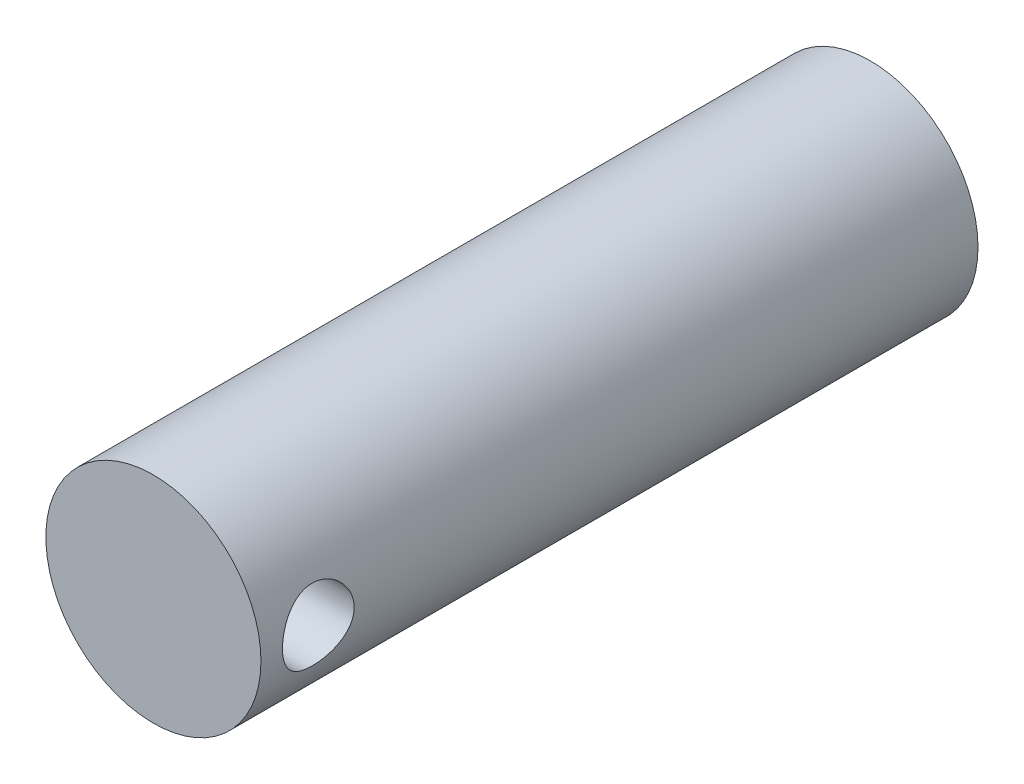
ISO-10303-21;
HEADER;
FILE_DESCRIPTION(('STEP AP214'),'2;1');
FILE_NAME('part.step','',(''),(''),'','','');
FILE_SCHEMA(('AUTOMOTIVE_DESIGN { 1 0 10303 214 1 1 1 1 }'));
ENDSEC;
DATA;
#1=APPLICATION_CONTEXT('core data for automotive mechanical design processes');
#2=APPLICATION_PROTOCOL_DEFINITION('international standard','automotive_design',2000,#1);
#3=PRODUCT_CONTEXT('',#1,'mechanical');
#4=PRODUCT('Part','Part','',(#3));
#5=PRODUCT_RELATED_PRODUCT_CATEGORY('part','',(#4));
#6=PRODUCT_DEFINITION_FORMATION('','',#4);
#7=PRODUCT_DEFINITION_CONTEXT('part definition',#1,'design');
#8=PRODUCT_DEFINITION('design','',#6,#7);
#9=PRODUCT_DEFINITION_SHAPE('','',#8);
#10=(LENGTH_UNIT() NAMED_UNIT(*) SI_UNIT(.MILLI.,.METRE.));
#11=(NAMED_UNIT(*) PLANE_ANGLE_UNIT() SI_UNIT($,.RADIAN.));
#12=(NAMED_UNIT(*) SI_UNIT($,.STERADIAN.) SOLID_ANGLE_UNIT());
#13=UNCERTAINTY_MEASURE_WITH_UNIT(LENGTH_MEASURE(1.E-05),#10,'distance_accuracy_value','');
#14=(GEOMETRIC_REPRESENTATION_CONTEXT(3) GLOBAL_UNCERTAINTY_ASSIGNED_CONTEXT((#13)) GLOBAL_UNIT_ASSIGNED_CONTEXT((#10,
#11,#12)) REPRESENTATION_CONTEXT('',''));
#15=CARTESIAN_POINT('',(0.,0.,0.));
#16=DIRECTION('',(0.,0.,1.));
#17=DIRECTION('',(1.,0.,0.));
#18=AXIS2_PLACEMENT_3D('',#15,#16,#17);
#19=CARTESIAN_POINT('',(0.,0.,50.));
#20=DIRECTION('',(0.,0.,-1.));
#21=DIRECTION('',(-1.,0.,0.));
#22=AXIS2_PLACEMENT_3D('',#19,#20,#21);
#23=CYLINDRICAL_SURFACE('',#22,7.5);
#24=CARTESIAN_POINT('',(-7.5,0.,48.5));
#25=CARTESIAN_POINT('',(-7.5000003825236,-0.136408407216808,48.5000006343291));
#26=CARTESIAN_POINT('',(-7.49624423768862,-0.272812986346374,48.488799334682));
#27=CARTESIAN_POINT('',(-7.48163025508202,-0.54160440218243,48.444427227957));
#28=CARTESIAN_POINT('',(-7.47077168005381,-0.673990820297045,48.4112541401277));
#29=CARTESIAN_POINT('',(-7.44313269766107,-0.93083197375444,48.3242018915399));
#30=CARTESIAN_POINT('',(-7.42636219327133,-1.05529956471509,48.2703573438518));
#31=CARTESIAN_POINT('',(-7.38861114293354,-1.29343734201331,48.1436470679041));
#32=CARTESIAN_POINT('',(-7.36762976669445,-1.40710539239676,48.0707775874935));
#33=CARTESIAN_POINT('',(-7.32285236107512,-1.62435418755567,47.9054354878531));
#34=CARTESIAN_POINT('',(-7.29898891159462,-1.72750925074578,47.8124219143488));
#35=CARTESIAN_POINT('',(-7.25150786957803,-1.91708173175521,47.6105821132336));
#36=CARTESIAN_POINT('',(-7.22789033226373,-2.00349546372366,47.5017524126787));
#37=CARTESIAN_POINT('',(-7.18283331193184,-2.15956235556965,47.2675372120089));
#38=CARTESIAN_POINT('',(-7.1614759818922,-2.22866214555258,47.1417656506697));
#39=CARTESIAN_POINT('',(-7.12438263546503,-2.3445471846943,46.8795597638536));
#40=CARTESIAN_POINT('',(-7.10864490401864,-2.39133924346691,46.7431287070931));
#41=CARTESIAN_POINT('',(-7.08528258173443,-2.45968365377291,46.4683169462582));
#42=CARTESIAN_POINT('',(-7.07740239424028,-2.48203362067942,46.3301569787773));
#43=CARTESIAN_POINT('',(-7.06989141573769,-2.5033528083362,46.0518406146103));
#44=CARTESIAN_POINT('',(-7.07025807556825,-2.5023292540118,45.911684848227));
#45=CARTESIAN_POINT('',(-7.0789753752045,-2.47754975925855,45.6401584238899));
#46=CARTESIAN_POINT('',(-7.08696039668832,-2.45483478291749,45.5086789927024));
#47=CARTESIAN_POINT('',(-7.10941644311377,-2.38901540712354,45.2515164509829));
#48=CARTESIAN_POINT('',(-7.12388824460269,-2.34590856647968,45.1258340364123));
#49=CARTESIAN_POINT('',(-7.15794777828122,-2.23984764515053,44.8814681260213));
#50=CARTESIAN_POINT('',(-7.17761414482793,-2.17658512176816,44.7629299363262));
#51=CARTESIAN_POINT('',(-7.21981396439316,-2.03222276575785,44.5378227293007));
#52=CARTESIAN_POINT('',(-7.24234824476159,-1.95111778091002,44.4312571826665));
#53=CARTESIAN_POINT('',(-7.28918322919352,-1.7683733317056,44.2272710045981));
#54=CARTESIAN_POINT('',(-7.31351473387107,-1.66588287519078,44.1306182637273));
#55=CARTESIAN_POINT('',(-7.36017345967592,-1.44584892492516,43.9556718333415));
#56=CARTESIAN_POINT('',(-7.38250048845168,-1.32830398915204,43.8773799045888));
#57=CARTESIAN_POINT('',(-7.42292769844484,-1.07986903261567,43.7407592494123));
#58=CARTESIAN_POINT('',(-7.44098375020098,-0.948858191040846,43.6826362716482));
#59=CARTESIAN_POINT('',(-7.47051417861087,-0.678172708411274,43.5894920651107));
#60=CARTESIAN_POINT('',(-7.48199084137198,-0.538501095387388,43.5544628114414));
#61=CARTESIAN_POINT('',(-7.49669067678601,-0.260959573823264,43.5098608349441));
#62=CARTESIAN_POINT('',(-7.5002500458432,-0.123273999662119,43.4992504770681));
#63=CARTESIAN_POINT('',(-7.49972256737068,0.15193767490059,43.5008316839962));
#64=CARTESIAN_POINT('',(-7.49563701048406,0.289463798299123,43.5130193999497));
#65=CARTESIAN_POINT('',(-7.48050061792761,0.556299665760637,43.5590297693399));
#66=CARTESIAN_POINT('',(-7.46965496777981,0.685732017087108,43.5922155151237));
#67=CARTESIAN_POINT('',(-7.44229617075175,0.937139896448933,43.6784836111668));
#68=CARTESIAN_POINT('',(-7.42578230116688,1.05911447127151,43.7315684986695));
#69=CARTESIAN_POINT('',(-7.38822328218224,1.29572074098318,43.857676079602));
#70=CARTESIAN_POINT('',(-7.36707036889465,1.41007489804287,43.9311864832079));
#71=CARTESIAN_POINT('',(-7.32263134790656,1.62516207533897,44.0954853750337));
#72=CARTESIAN_POINT('',(-7.29934458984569,1.72589091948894,44.1862791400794));
#73=CARTESIAN_POINT('',(-7.25192119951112,1.91563126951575,44.3874468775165));
#74=CARTESIAN_POINT('',(-7.2277940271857,2.00390242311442,44.4985230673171));
#75=CARTESIAN_POINT('',(-7.18249933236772,2.16064380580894,44.7344289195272));
#76=CARTESIAN_POINT('',(-7.16133183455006,2.22911386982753,44.8592586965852));
#77=CARTESIAN_POINT('',(-7.12455979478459,2.34399232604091,45.1191825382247));
#78=CARTESIAN_POINT('',(-7.10894401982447,2.39044533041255,45.2542551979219));
#79=CARTESIAN_POINT('',(-7.08527080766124,2.45973666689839,45.5309466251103));
#80=CARTESIAN_POINT('',(-7.07720996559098,2.48258563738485,45.6725624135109));
#81=CARTESIAN_POINT('',(-7.06994647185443,2.50319070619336,45.9504927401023));
#82=CARTESIAN_POINT('',(-7.07031000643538,2.502175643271,46.0867058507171));
#83=CARTESIAN_POINT('',(-7.07878174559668,2.47810573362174,46.3569126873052));
#84=CARTESIAN_POINT('',(-7.08688948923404,2.45505219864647,46.4909065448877));
#85=CARTESIAN_POINT('',(-7.10961310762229,2.38842953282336,46.7503391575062));
#86=CARTESIAN_POINT('',(-7.12410245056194,2.34525836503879,46.8758920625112));
#87=CARTESIAN_POINT('',(-7.15790997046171,2.23994841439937,47.1180685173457));
#88=CARTESIAN_POINT('',(-7.17722921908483,2.17780542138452,47.23469007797));
#89=CARTESIAN_POINT('',(-7.21957073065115,2.03315173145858,47.4612091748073));
#90=CARTESIAN_POINT('',(-7.24271779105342,1.94987060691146,47.570591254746));
#91=CARTESIAN_POINT('',(-7.28958390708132,1.76660720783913,47.7742245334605));
#92=CARTESIAN_POINT('',(-7.3133031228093,1.66662021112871,47.8684714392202));
#93=CARTESIAN_POINT('',(-7.3597507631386,1.44810389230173,48.0428610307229));
#94=CARTESIAN_POINT('',(-7.38240454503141,1.32900378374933,48.1223108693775));
#95=CARTESIAN_POINT('',(-7.4231497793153,1.07839339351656,48.2599760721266));
#96=CARTESIAN_POINT('',(-7.44124239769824,0.946886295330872,48.3181968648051));
#97=CARTESIAN_POINT('',(-7.47013787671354,0.681234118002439,48.4093040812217));
#98=CARTESIAN_POINT('',(-7.48123031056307,0.547469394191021,48.4432061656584));
#99=CARTESIAN_POINT('',(-7.49616017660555,0.275801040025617,48.4885507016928));
#100=CARTESIAN_POINT('',(-7.49999961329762,0.137898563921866,48.4999993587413));
#101=CARTESIAN_POINT('',(-7.5,0.,48.5));
#102=B_SPLINE_CURVE_WITH_KNOTS('',3,(#24,#25,#26,#27,#28,#29,#30,#31,#32,#33,#34,#35,#36,#37,
#38,#39,#40,#41,#42,#43,#44,#45,#46,#47,#48,#49,#50,#51,#52,#53,#54,#55,#56,#57,#58,#59,#60,#61,
#62,#63,#64,#65,#66,#67,#68,#69,#70,#71,#72,#73,#74,#75,#76,#77,#78,#79,#80,#81,#82,#83,#84,#85,
#86,#87,#88,#89,#90,#91,#92,#93,#94,#95,#96,#97,#98,#99,#100,#101),.UNSPECIFIED.,.T.,.F.,(4,2,2,
2,2,2,2,2,2,2,2,2,2,2,2,2,2,2,2,2,2,2,2,2,2,2,2,2,2,2,2,2,2,2,2,2,2,2,4),(0.,0.408717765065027,
0.817477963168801,1.22555668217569,1.63371594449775,2.0546171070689,2.47561083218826,
2.90870962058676,3.34167611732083,3.760048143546,4.17829084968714,4.57742066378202,
4.97659827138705,5.38220427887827,5.78792756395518,6.21483264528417,6.64177864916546,
7.07296014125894,7.50399172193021,7.91633957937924,8.32861782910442,8.72895394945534,
9.1293411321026,9.54025999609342,9.95130452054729,10.3810255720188,10.8107502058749,
11.2396003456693,11.668257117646,12.0748916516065,12.4815019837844,12.8803896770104,
13.2793659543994,13.6957516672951,14.1122552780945,14.5449915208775,14.9776170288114,
15.3909139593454,15.8040966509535),.UNSPECIFIED.);
#103=CARTESIAN_POINT('',(-7.5,0.,48.5));
#104=VERTEX_POINT('',#103);
#105=EDGE_CURVE('E36',#104,#104,#102,.T.);
#106=ORIENTED_EDGE('',*,*,#105,.T.);
#107=EDGE_LOOP('',(#106));
#108=FACE_BOUND('',#107,.T.);
#109=CARTESIAN_POINT('',(7.5,0.,43.5));
#110=CARTESIAN_POINT('',(7.5000003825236,-0.136408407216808,43.4999993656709));
#111=CARTESIAN_POINT('',(7.49624423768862,-0.272812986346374,43.511200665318));
#112=CARTESIAN_POINT('',(7.48163025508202,-0.54160440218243,43.555572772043));
#113=CARTESIAN_POINT('',(7.47077168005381,-0.673990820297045,43.5887458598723));
#114=CARTESIAN_POINT('',(7.44313269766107,-0.93083197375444,43.6757981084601));
#115=CARTESIAN_POINT('',(7.42636219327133,-1.05529956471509,43.7296426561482));
#116=CARTESIAN_POINT('',(7.38861114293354,-1.29343734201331,43.8563529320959));
#117=CARTESIAN_POINT('',(7.36762976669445,-1.40710539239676,43.9292224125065));
#118=CARTESIAN_POINT('',(7.32285236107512,-1.62435418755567,44.0945645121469));
#119=CARTESIAN_POINT('',(7.29898891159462,-1.72750925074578,44.1875780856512));
#120=CARTESIAN_POINT('',(7.25150786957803,-1.91708173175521,44.3894178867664));
#121=CARTESIAN_POINT('',(7.22789033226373,-2.00349546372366,44.4982475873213));
#122=CARTESIAN_POINT('',(7.18283331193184,-2.15956235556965,44.7324627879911));
#123=CARTESIAN_POINT('',(7.1614759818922,-2.22866214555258,44.8582343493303));
#124=CARTESIAN_POINT('',(7.12438263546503,-2.3445471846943,45.1204402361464));
#125=CARTESIAN_POINT('',(7.10864490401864,-2.39133924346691,45.2568712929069));
#126=CARTESIAN_POINT('',(7.08528258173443,-2.45968365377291,45.5316830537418));
#127=CARTESIAN_POINT('',(7.07740239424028,-2.48203362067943,45.6698430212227));
#128=CARTESIAN_POINT('',(7.06989141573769,-2.5033528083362,45.9481593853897));
#129=CARTESIAN_POINT('',(7.07025807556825,-2.5023292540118,46.088315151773));
#130=CARTESIAN_POINT('',(7.0789753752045,-2.47754975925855,46.3598415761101));
#131=CARTESIAN_POINT('',(7.08696039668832,-2.45483478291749,46.4913210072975));
#132=CARTESIAN_POINT('',(7.10941644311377,-2.38901540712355,46.7484835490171));
#133=CARTESIAN_POINT('',(7.12388824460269,-2.34590856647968,46.8741659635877));
#134=CARTESIAN_POINT('',(7.15794777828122,-2.23984764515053,47.1185318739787));
#135=CARTESIAN_POINT('',(7.17761414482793,-2.17658512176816,47.2370700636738));
#136=CARTESIAN_POINT('',(7.21981396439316,-2.03222276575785,47.4621772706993));
#137=CARTESIAN_POINT('',(7.24234824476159,-1.95111778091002,47.5687428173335));
#138=CARTESIAN_POINT('',(7.28918322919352,-1.7683733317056,47.7727289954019));
#139=CARTESIAN_POINT('',(7.31351473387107,-1.66588287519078,47.8693817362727));
#140=CARTESIAN_POINT('',(7.36017345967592,-1.44584892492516,48.0443281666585));
#141=CARTESIAN_POINT('',(7.38250048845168,-1.32830398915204,48.1226200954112));
#142=CARTESIAN_POINT('',(7.42292769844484,-1.07986903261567,48.2592407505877));
#143=CARTESIAN_POINT('',(7.44098375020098,-0.948858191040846,48.3173637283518));
#144=CARTESIAN_POINT('',(7.47051417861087,-0.678172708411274,48.4105079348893));
#145=CARTESIAN_POINT('',(7.48199084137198,-0.538501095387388,48.4455371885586));
#146=CARTESIAN_POINT('',(7.49669067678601,-0.260959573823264,48.4901391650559));
#147=CARTESIAN_POINT('',(7.5002500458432,-0.123273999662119,48.5007495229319));
#148=CARTESIAN_POINT('',(7.49972256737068,0.15193767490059,48.4991683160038));
#149=CARTESIAN_POINT('',(7.49563701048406,0.289463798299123,48.4869806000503));
#150=CARTESIAN_POINT('',(7.48050061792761,0.556299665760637,48.4409702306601));
#151=CARTESIAN_POINT('',(7.46965496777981,0.685732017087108,48.4077844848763));
#152=CARTESIAN_POINT('',(7.44229617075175,0.937139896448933,48.3215163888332));
#153=CARTESIAN_POINT('',(7.42578230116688,1.05911447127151,48.2684315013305));
#154=CARTESIAN_POINT('',(7.38822328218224,1.29572074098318,48.142323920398));
#155=CARTESIAN_POINT('',(7.36707036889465,1.41007489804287,48.0688135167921));
#156=CARTESIAN_POINT('',(7.32263134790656,1.62516207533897,47.9045146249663));
#157=CARTESIAN_POINT('',(7.29934458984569,1.72589091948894,47.8137208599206));
#158=CARTESIAN_POINT('',(7.25192119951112,1.91563126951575,47.6125531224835));
#159=CARTESIAN_POINT('',(7.2277940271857,2.00390242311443,47.5014769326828));
#160=CARTESIAN_POINT('',(7.18249933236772,2.16064380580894,47.2655710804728));
#161=CARTESIAN_POINT('',(7.16133183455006,2.22911386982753,47.1407413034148));
#162=CARTESIAN_POINT('',(7.12455979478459,2.34399232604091,46.8808174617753));
#163=CARTESIAN_POINT('',(7.10894401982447,2.39044533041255,46.7457448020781));
#164=CARTESIAN_POINT('',(7.08527080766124,2.45973666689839,46.4690533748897));
#165=CARTESIAN_POINT('',(7.07720996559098,2.48258563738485,46.3274375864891));
#166=CARTESIAN_POINT('',(7.06994647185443,2.50319070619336,46.0495072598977));
#167=CARTESIAN_POINT('',(7.07031000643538,2.502175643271,45.9132941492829));
#168=CARTESIAN_POINT('',(7.07878174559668,2.47810573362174,45.6430873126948));
#169=CARTESIAN_POINT('',(7.08688948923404,2.45505219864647,45.5090934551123));
#170=CARTESIAN_POINT('',(7.10961310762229,2.38842953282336,45.2496608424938));
#171=CARTESIAN_POINT('',(7.12410245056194,2.34525836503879,45.1241079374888));
#172=CARTESIAN_POINT('',(7.15790997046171,2.23994841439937,44.8819314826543));
#173=CARTESIAN_POINT('',(7.17722921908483,2.17780542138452,44.76530992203));
#174=CARTESIAN_POINT('',(7.21957073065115,2.03315173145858,44.5387908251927));
#175=CARTESIAN_POINT('',(7.24271779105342,1.94987060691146,44.429408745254));
#176=CARTESIAN_POINT('',(7.28958390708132,1.76660720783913,44.2257754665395));
#177=CARTESIAN_POINT('',(7.3133031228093,1.66662021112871,44.1315285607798));
#178=CARTESIAN_POINT('',(7.3597507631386,1.44810389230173,43.9571389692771));
#179=CARTESIAN_POINT('',(7.38240454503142,1.32900378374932,43.8776891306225));
#180=CARTESIAN_POINT('',(7.4231497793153,1.07839339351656,43.7400239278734));
#181=CARTESIAN_POINT('',(7.44124239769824,0.946886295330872,43.6818031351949));
#182=CARTESIAN_POINT('',(7.47013787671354,0.681234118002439,43.5906959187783));
#183=CARTESIAN_POINT('',(7.48123031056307,0.547469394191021,43.5567938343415));
#184=CARTESIAN_POINT('',(7.49616017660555,0.275801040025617,43.5114492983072));
#185=CARTESIAN_POINT('',(7.49999961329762,0.137898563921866,43.5000006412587));
#186=CARTESIAN_POINT('',(7.5,0.,43.5));
#187=B_SPLINE_CURVE_WITH_KNOTS('',3,(#109,#110,#111,#112,#113,#114,#115,#116,#117,#118,#119,
#120,#121,#122,#123,#124,#125,#126,#127,#128,#129,#130,#131,#132,#133,#134,#135,#136,#137,#138,
#139,#140,#141,#142,#143,#144,#145,#146,#147,#148,#149,#150,#151,#152,#153,#154,#155,#156,#157,
#158,#159,#160,#161,#162,#163,#164,#165,#166,#167,#168,#169,#170,#171,#172,#173,#174,#175,#176,
#177,#178,#179,#180,#181,#182,#183,#184,#185,#186),.UNSPECIFIED.,.T.,.F.,(4,2,2,2,2,2,2,2,2,2,2,
2,2,2,2,2,2,2,2,2,2,2,2,2,2,2,2,2,2,2,2,2,2,2,2,2,2,2,4),(0.,0.408717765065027,
0.817477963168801,1.22555668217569,1.63371594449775,2.0546171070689,2.47561083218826,
2.90870962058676,3.34167611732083,3.76004814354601,4.17829084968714,4.57742066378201,
4.97659827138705,5.38220427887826,5.78792756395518,6.21483264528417,6.64177864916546,
7.07296014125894,7.50399172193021,7.91633957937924,8.32861782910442,8.72895394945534,
9.1293411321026,9.54025999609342,9.95130452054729,10.3810255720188,10.8107502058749,
11.2396003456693,11.668257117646,12.0748916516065,12.4815019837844,12.8803896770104,
13.2793659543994,13.6957516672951,14.1122552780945,14.5449915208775,14.9776170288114,
15.3909139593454,15.8040966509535),.UNSPECIFIED.);
#188=CARTESIAN_POINT('',(7.5,0.,43.5));
#189=VERTEX_POINT('',#188);
#190=EDGE_CURVE('E50',#189,#189,#187,.T.);
#191=ORIENTED_EDGE('',*,*,#190,.T.);
#192=EDGE_LOOP('',(#191));
#193=FACE_BOUND('',#192,.T.);
#194=CARTESIAN_POINT('',(0.,0.,50.));
#195=DIRECTION('',(0.,0.,1.));
#196=DIRECTION('',(1.,0.,0.));
#197=AXIS2_PLACEMENT_3D('',#194,#195,#196);
#198=CIRCLE('',#197,7.5);
#199=CARTESIAN_POINT('',(7.5,0.,50.));
#200=VERTEX_POINT('',#199);
#201=EDGE_CURVE('E10',#200,#200,#198,.T.);
#202=ORIENTED_EDGE('',*,*,#201,.F.);
#203=EDGE_LOOP('',(#202));
#204=FACE_BOUND('',#203,.T.);
#205=CARTESIAN_POINT('',(0.,0.,0.));
#206=DIRECTION('',(0.,0.,1.));
#207=DIRECTION('',(1.,0.,0.));
#208=AXIS2_PLACEMENT_3D('',#205,#206,#207);
#209=CIRCLE('',#208,7.5);
#210=CARTESIAN_POINT('',(7.5,0.,0.));
#211=VERTEX_POINT('',#210);
#212=EDGE_CURVE('E44',#211,#211,#209,.T.);
#213=ORIENTED_EDGE('',*,*,#212,.T.);
#214=EDGE_LOOP('',(#213));
#215=FACE_BOUND('',#214,.T.);
#216=ADVANCED_FACE('F32',(#108,#193,#204,#215),#23,.T.);
#217=CARTESIAN_POINT('',(0.,0.,50.));
#218=DIRECTION('',(0.,0.,1.));
#219=DIRECTION('',(1.,0.,0.));
#220=AXIS2_PLACEMENT_3D('',#217,#218,#219);
#221=PLANE('',#220);
#222=ORIENTED_EDGE('',*,*,#201,.T.);
#223=EDGE_LOOP('',(#222));
#224=FACE_BOUND('',#223,.T.);
#225=ADVANCED_FACE('F61',(#224),#221,.T.);
#226=CARTESIAN_POINT('',(0.,0.,0.));
#227=DIRECTION('',(0.,0.,1.));
#228=DIRECTION('',(1.,0.,0.));
#229=AXIS2_PLACEMENT_3D('',#226,#227,#228);
#230=PLANE('',#229);
#231=ORIENTED_EDGE('',*,*,#212,.F.);
#232=EDGE_LOOP('',(#231));
#233=FACE_BOUND('',#232,.T.);
#234=ADVANCED_FACE('F59',(#233),#230,.F.);
#235=CARTESIAN_POINT('',(-25.,0.,46.));
#236=DIRECTION('',(1.,0.,0.));
#237=DIRECTION('',(0.,0.,-1.));
#238=AXIS2_PLACEMENT_3D('',#235,#236,#237);
#239=CYLINDRICAL_SURFACE('',#238,2.5);
#240=ORIENTED_EDGE('',*,*,#190,.F.);
#241=EDGE_LOOP('',(#240));
#242=FACE_BOUND('',#241,.T.);
#243=ORIENTED_EDGE('',*,*,#105,.F.);
#244=EDGE_LOOP('',(#243));
#245=FACE_BOUND('',#244,.T.);
#246=ADVANCED_FACE('F55',(#242,#245),#239,.F.);
#247=CLOSED_SHELL('',(#216,#225,#234,#246));
#248=MANIFOLD_SOLID_BREP('B2',#247);
#249=ADVANCED_BREP_SHAPE_REPRESENTATION('',(#18,#248),#14);
#250=SHAPE_DEFINITION_REPRESENTATION(#9,#249);
ENDSEC;
END-ISO-10303-21;
